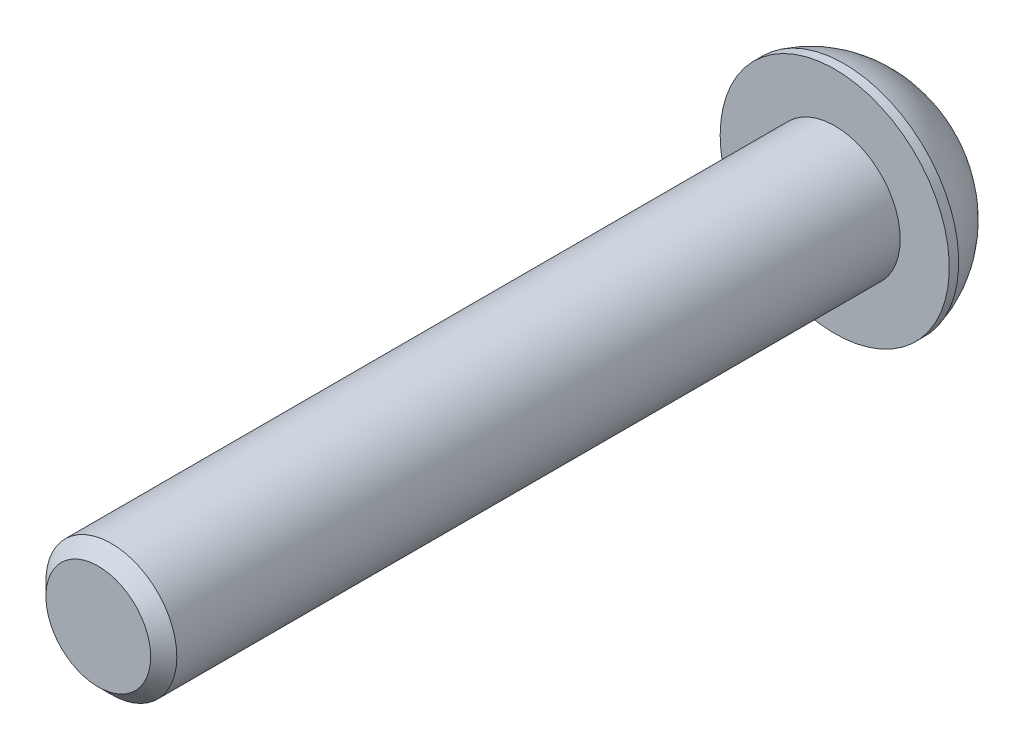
from build123d import *

# Parameters (mm, degrees)
ENLEV_MAT_EXTRU1_DEPTH = 2.6
ESQUISSE3_W            = 4
ESQUISSE3_H            = 45
CHANFREIN1_SIZE        = 0.8


with BuildPart() as part:
    # Esquisse1 → Base-R_volution (revolve)
    with BuildSketch(Plane(origin=(0, 0, 0), x_dir=(1, 0, 0), z_dir=(0, 1, 0)), mode=Mode.PRIVATE) as base_r_volution_sk:
        with BuildLine():
            Line((0, 0), (7, 0))
            Line((7, 0), (7, 0.574933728))
            ThreePointArc((7, 0.574933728), (5.912888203, 2.77937838), (4.064923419, 4.4))
            Line((4.064923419, 4.4), (0, 4.4))
            Line((0, 4.4), (0, 0))
        make_face()
    revolve(base_r_volution_sk.sketch.rotate(Axis((0, 0, 0), (0, 0, -1)), 180), axis=Axis((0, 0, 0), (0, 0, -1)))

    # Esquisse2 → enlev-mat-Extru1 (cut)
    with BuildSketch(Plane.XY.offset(-4.4)):
        Polygon((2.5, -1.443375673), (2.5, 1.443375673), (0, 2.886751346), (-2.5, 1.443375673), (-2.5, -1.443375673), (0, -2.886751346), align=None)
    extrude(amount=ENLEV_MAT_EXTRU1_DEPTH, mode=Mode.SUBTRACT)

    # Esquisse3 → Boss.-R_vol.1 (revolve)
    with BuildSketch(Plane(origin=(0, 0, 0), x_dir=(1, 0, 0), z_dir=(0, 1, 0)), mode=Mode.PRIVATE) as boss_r_vol_1_sk:
        with Locations((2, -22.5)):
            Rectangle(ESQUISSE3_W, ESQUISSE3_H)
    revolve(boss_r_vol_1_sk.sketch.rotate(Axis((0, 0, 0), (0, 0, 1)), 180), axis=Axis((0, 0, 0), (0, 0, 1)))

    # Chanfrein1
    chanfrein1_edges = [part.edges().sort_by_distance(p)[0] for p in [
        (4, 0, 45),
    ]]
    chamfer(chanfrein1_edges, length=CHANFREIN1_SIZE)


solid = part.part
